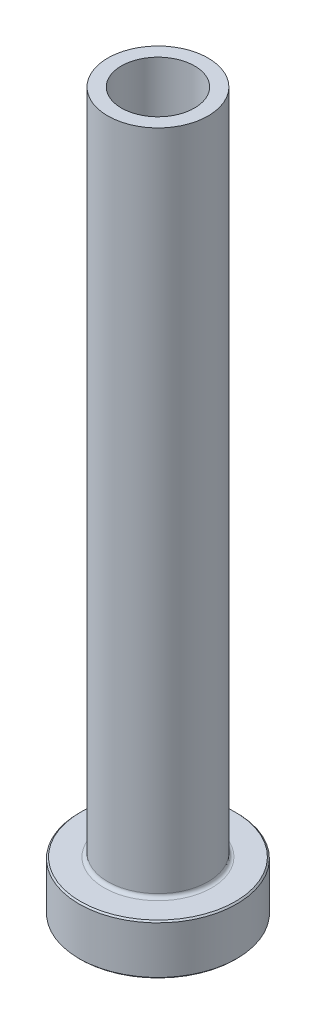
ISO-10303-21;
HEADER;
FILE_DESCRIPTION(('STEP AP214'),'2;1');
FILE_NAME('part.step','',(''),(''),'','','');
FILE_SCHEMA(('AUTOMOTIVE_DESIGN { 1 0 10303 214 1 1 1 1 }'));
ENDSEC;
DATA;
#1=APPLICATION_CONTEXT('core data for automotive mechanical design processes');
#2=APPLICATION_PROTOCOL_DEFINITION('international standard','automotive_design',2000,#1);
#3=PRODUCT_CONTEXT('',#1,'mechanical');
#4=PRODUCT('Part','Part','',(#3));
#5=PRODUCT_RELATED_PRODUCT_CATEGORY('part','',(#4));
#6=PRODUCT_DEFINITION_FORMATION('','',#4);
#7=PRODUCT_DEFINITION_CONTEXT('part definition',#1,'design');
#8=PRODUCT_DEFINITION('design','',#6,#7);
#9=PRODUCT_DEFINITION_SHAPE('','',#8);
#10=(LENGTH_UNIT() NAMED_UNIT(*) SI_UNIT(.MILLI.,.METRE.));
#11=(NAMED_UNIT(*) PLANE_ANGLE_UNIT() SI_UNIT($,.RADIAN.));
#12=(NAMED_UNIT(*) SI_UNIT($,.STERADIAN.) SOLID_ANGLE_UNIT());
#13=UNCERTAINTY_MEASURE_WITH_UNIT(LENGTH_MEASURE(1.E-05),#10,'distance_accuracy_value','');
#14=(GEOMETRIC_REPRESENTATION_CONTEXT(3) GLOBAL_UNCERTAINTY_ASSIGNED_CONTEXT((#13)) GLOBAL_UNIT_ASSIGNED_CONTEXT((#10,
#11,#12)) REPRESENTATION_CONTEXT('',''));
#15=CARTESIAN_POINT('',(0.,0.,0.));
#16=DIRECTION('',(0.,0.,1.));
#17=DIRECTION('',(1.,0.,0.));
#18=AXIS2_PLACEMENT_3D('',#15,#16,#17);
#19=CARTESIAN_POINT('',(0.,92.1876809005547,0.));
#20=DIRECTION('',(0.,1.,0.));
#21=DIRECTION('',(0.,0.,1.));
#22=AXIS2_PLACEMENT_3D('',#19,#20,#21);
#23=CYLINDRICAL_SURFACE('',#22,5.09999999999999);
#24=CARTESIAN_POINT('',(0.,100.,0.));
#25=DIRECTION('',(0.,1.,0.));
#26=DIRECTION('',(0.,0.,1.));
#27=AXIS2_PLACEMENT_3D('',#24,#25,#26);
#28=CIRCLE('',#27,5.09999999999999);
#29=CARTESIAN_POINT('',(0.,100.,5.09999999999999));
#30=VERTEX_POINT('',#29);
#31=EDGE_CURVE('E62',#30,#30,#28,.T.);
#32=ORIENTED_EDGE('',*,*,#31,.T.);
#33=EDGE_LOOP('',(#32));
#34=FACE_BOUND('',#33,.T.);
#35=CARTESIAN_POINT('',(0.,45.,0.));
#36=DIRECTION('',(0.,1.,0.));
#37=DIRECTION('',(0.,0.,1.));
#38=AXIS2_PLACEMENT_3D('',#35,#36,#37);
#39=CIRCLE('',#38,5.09999999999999);
#40=CARTESIAN_POINT('',(0.,45.,5.09999999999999));
#41=VERTEX_POINT('',#40);
#42=EDGE_CURVE('E71',#41,#41,#39,.T.);
#43=ORIENTED_EDGE('',*,*,#42,.F.);
#44=EDGE_LOOP('',(#43));
#45=FACE_BOUND('',#44,.T.);
#46=ADVANCED_FACE('F30',(#34,#45),#23,.F.);
#47=CARTESIAN_POINT('',(-5.09999999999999,100.,0.));
#48=DIRECTION('',(0.,1.,0.));
#49=DIRECTION('',(0.,0.,1.));
#50=AXIS2_PLACEMENT_3D('',#47,#48,#49);
#51=PLANE('',#50);
#52=CARTESIAN_POINT('',(0.,100.,0.));
#53=DIRECTION('',(0.,1.,0.));
#54=DIRECTION('',(0.,0.,1.));
#55=AXIS2_PLACEMENT_3D('',#52,#53,#54);
#56=CIRCLE('',#55,7.);
#57=CARTESIAN_POINT('',(0.,100.,7.));
#58=VERTEX_POINT('',#57);
#59=EDGE_CURVE('E65',#58,#58,#56,.T.);
#60=ORIENTED_EDGE('',*,*,#59,.T.);
#61=EDGE_LOOP('',(#60));
#62=FACE_BOUND('',#61,.T.);
#63=ORIENTED_EDGE('',*,*,#31,.F.);
#64=EDGE_LOOP('',(#63));
#65=FACE_BOUND('',#64,.T.);
#66=ADVANCED_FACE('F79',(#62,#65),#51,.T.);
#67=CARTESIAN_POINT('',(0.,92.1876809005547,0.));
#68=DIRECTION('',(0.,1.,0.));
#69=DIRECTION('',(0.,0.,1.));
#70=AXIS2_PLACEMENT_3D('',#67,#68,#69);
#71=CYLINDRICAL_SURFACE('',#70,7.);
#72=CARTESIAN_POINT('',(0.,7.50000000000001,0.));
#73=DIRECTION('',(0.,1.,0.));
#74=DIRECTION('',(0.,0.,1.));
#75=AXIS2_PLACEMENT_3D('',#72,#73,#74);
#76=CIRCLE('',#75,7.);
#77=CARTESIAN_POINT('',(0.,7.50000000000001,7.));
#78=VERTEX_POINT('',#77);
#79=EDGE_CURVE('E59',#78,#78,#76,.T.);
#80=ORIENTED_EDGE('',*,*,#79,.T.);
#81=EDGE_LOOP('',(#80));
#82=FACE_BOUND('',#81,.T.);
#83=ORIENTED_EDGE('',*,*,#59,.F.);
#84=EDGE_LOOP('',(#83));
#85=FACE_BOUND('',#84,.T.);
#86=ADVANCED_FACE('F85',(#82,#85),#71,.T.);
#87=CARTESIAN_POINT('',(-6.99999999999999,7.,0.));
#88=DIRECTION('',(0.,1.,0.));
#89=DIRECTION('',(0.,0.,1.));
#90=AXIS2_PLACEMENT_3D('',#87,#88,#89);
#91=PLANE('',#90);
#92=CARTESIAN_POINT('',(0.,7.,0.));
#93=DIRECTION('',(0.,1.,0.));
#94=DIRECTION('',(0.,0.,1.));
#95=AXIS2_PLACEMENT_3D('',#92,#93,#94);
#96=CIRCLE('',#95,10.8);
#97=CARTESIAN_POINT('',(0.,7.,10.8));
#98=VERTEX_POINT('',#97);
#99=EDGE_CURVE('E53',#98,#98,#96,.T.);
#100=ORIENTED_EDGE('',*,*,#99,.T.);
#101=EDGE_LOOP('',(#100));
#102=FACE_BOUND('',#101,.T.);
#103=CARTESIAN_POINT('',(0.,7.,0.));
#104=DIRECTION('',(0.,1.,0.));
#105=DIRECTION('',(0.,0.,1.));
#106=AXIS2_PLACEMENT_3D('',#103,#104,#105);
#107=CIRCLE('',#106,7.5);
#108=CARTESIAN_POINT('',(0.,7.,7.5));
#109=VERTEX_POINT('',#108);
#110=EDGE_CURVE('E56',#109,#109,#107,.F.);
#111=ORIENTED_EDGE('',*,*,#110,.T.);
#112=EDGE_LOOP('',(#111));
#113=FACE_BOUND('',#112,.T.);
#114=ADVANCED_FACE('F111',(#102,#113),#91,.T.);
#115=CARTESIAN_POINT('',(0.,92.1876809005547,0.));
#116=DIRECTION('',(0.,1.,0.));
#117=DIRECTION('',(0.,0.,1.));
#118=AXIS2_PLACEMENT_3D('',#115,#116,#117);
#119=CYLINDRICAL_SURFACE('',#118,11.);
#120=CARTESIAN_POINT('',(0.,6.80000000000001,0.));
#121=DIRECTION('',(0.,1.,0.));
#122=DIRECTION('',(0.,0.,1.));
#123=AXIS2_PLACEMENT_3D('',#120,#121,#122);
#124=CIRCLE('',#123,11.);
#125=CARTESIAN_POINT('',(0.,6.80000000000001,11.));
#126=VERTEX_POINT('',#125);
#127=EDGE_CURVE('E45',#126,#126,#124,.F.);
#128=ORIENTED_EDGE('',*,*,#127,.T.);
#129=EDGE_LOOP('',(#128));
#130=FACE_BOUND('',#129,.T.);
#131=CARTESIAN_POINT('',(0.,0.20000000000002,0.));
#132=DIRECTION('',(0.,-1.,0.));
#133=DIRECTION('',(0.,0.,-1.));
#134=AXIS2_PLACEMENT_3D('',#131,#132,#133);
#135=CIRCLE('',#134,11.);
#136=CARTESIAN_POINT('',(0.,0.20000000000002,-11.));
#137=VERTEX_POINT('',#136);
#138=EDGE_CURVE('E50',#137,#137,#135,.F.);
#139=ORIENTED_EDGE('',*,*,#138,.T.);
#140=EDGE_LOOP('',(#139));
#141=FACE_BOUND('',#140,.T.);
#142=ADVANCED_FACE('F108',(#130,#141),#119,.T.);
#143=CARTESIAN_POINT('',(-11.,0.,0.));
#144=DIRECTION('',(0.,-1.,0.));
#145=DIRECTION('',(0.,0.,-1.));
#146=AXIS2_PLACEMENT_3D('',#143,#144,#145);
#147=PLANE('',#146);
#148=CARTESIAN_POINT('',(0.,0.,0.));
#149=DIRECTION('',(0.,-1.,0.));
#150=DIRECTION('',(0.,0.,-1.));
#151=AXIS2_PLACEMENT_3D('',#148,#149,#150);
#152=CIRCLE('',#151,5.85000000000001);
#153=CARTESIAN_POINT('',(0.,0.,-5.85000000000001));
#154=VERTEX_POINT('',#153);
#155=EDGE_CURVE('E37',#154,#154,#152,.F.);
#156=ORIENTED_EDGE('',*,*,#155,.T.);
#157=EDGE_LOOP('',(#156));
#158=FACE_BOUND('',#157,.T.);
#159=CARTESIAN_POINT('',(0.,0.,0.));
#160=DIRECTION('',(0.,-1.,0.));
#161=DIRECTION('',(0.,0.,-1.));
#162=AXIS2_PLACEMENT_3D('',#159,#160,#161);
#163=CIRCLE('',#162,10.8);
#164=CARTESIAN_POINT('',(0.,0.,-10.8));
#165=VERTEX_POINT('',#164);
#166=EDGE_CURVE('E41',#165,#165,#163,.T.);
#167=ORIENTED_EDGE('',*,*,#166,.T.);
#168=EDGE_LOOP('',(#167));
#169=FACE_BOUND('',#168,.T.);
#170=ADVANCED_FACE('F110',(#158,#169),#147,.T.);
#171=CARTESIAN_POINT('',(0.,92.1876809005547,0.));
#172=DIRECTION('',(0.,1.,0.));
#173=DIRECTION('',(0.,0.,1.));
#174=AXIS2_PLACEMENT_3D('',#171,#172,#173);
#175=CYLINDRICAL_SURFACE('',#174,5.34999999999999);
#176=CARTESIAN_POINT('',(0.,0.500000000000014,0.));
#177=DIRECTION('',(0.,-1.,0.));
#178=DIRECTION('',(0.,0.,-1.));
#179=AXIS2_PLACEMENT_3D('',#176,#177,#178);
#180=CIRCLE('',#179,5.34999999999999);
#181=CARTESIAN_POINT('',(0.,0.500000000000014,-5.34999999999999));
#182=VERTEX_POINT('',#181);
#183=EDGE_CURVE('E10',#182,#182,#180,.T.);
#184=ORIENTED_EDGE('',*,*,#183,.T.);
#185=EDGE_LOOP('',(#184));
#186=FACE_BOUND('',#185,.T.);
#187=CARTESIAN_POINT('',(0.,33.,0.));
#188=DIRECTION('',(0.,1.,0.));
#189=DIRECTION('',(0.,0.,1.));
#190=AXIS2_PLACEMENT_3D('',#187,#188,#189);
#191=CIRCLE('',#190,5.34999999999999);
#192=CARTESIAN_POINT('',(0.,33.,5.34999999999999));
#193=VERTEX_POINT('',#192);
#194=EDGE_CURVE('E68',#193,#193,#191,.T.);
#195=ORIENTED_EDGE('',*,*,#194,.T.);
#196=EDGE_LOOP('',(#195));
#197=FACE_BOUND('',#196,.T.);
#198=ADVANCED_FACE('F118',(#186,#197),#175,.F.);
#199=CARTESIAN_POINT('',(0.,33.,0.));
#200=DIRECTION('',(0.,-1.,0.));
#201=DIRECTION('',(0.,0.,-1.));
#202=AXIS2_PLACEMENT_3D('',#199,#200,#201);
#203=CONICAL_SURFACE('',#202,5.34999999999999,0.0208303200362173);
#204=ORIENTED_EDGE('',*,*,#42,.T.);
#205=EDGE_LOOP('',(#204));
#206=FACE_BOUND('',#205,.T.);
#207=ORIENTED_EDGE('',*,*,#194,.F.);
#208=EDGE_LOOP('',(#207));
#209=FACE_BOUND('',#208,.T.);
#210=ADVANCED_FACE('F75',(#206,#209),#203,.F.);
#211=CARTESIAN_POINT('',(0.,7.50000000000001,0.));
#212=DIRECTION('',(0.,1.,0.));
#213=DIRECTION('',(0.,0.,1.));
#214=AXIS2_PLACEMENT_3D('',#211,#212,#213);
#215=TOROIDAL_SURFACE('',#214,7.5,0.5);
#216=ORIENTED_EDGE('',*,*,#110,.F.);
#217=EDGE_LOOP('',(#216));
#218=FACE_BOUND('',#217,.T.);
#219=ORIENTED_EDGE('',*,*,#79,.F.);
#220=EDGE_LOOP('',(#219));
#221=FACE_BOUND('',#220,.T.);
#222=ADVANCED_FACE('F90',(#218,#221),#215,.F.);
#223=CARTESIAN_POINT('',(0.,7.00000000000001,0.));
#224=DIRECTION('',(0.,-1.,0.));
#225=DIRECTION('',(0.,0.,-1.));
#226=AXIS2_PLACEMENT_3D('',#223,#224,#225);
#227=CONICAL_SURFACE('',#226,10.8,0.785398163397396);
#228=ORIENTED_EDGE('',*,*,#127,.F.);
#229=EDGE_LOOP('',(#228));
#230=FACE_BOUND('',#229,.T.);
#231=ORIENTED_EDGE('',*,*,#99,.F.);
#232=EDGE_LOOP('',(#231));
#233=FACE_BOUND('',#232,.T.);
#234=ADVANCED_FACE('F93',(#230,#233),#227,.T.);
#235=CARTESIAN_POINT('',(0.,0.20000000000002,0.));
#236=DIRECTION('',(0.,1.,0.));
#237=DIRECTION('',(0.,0.,1.));
#238=AXIS2_PLACEMENT_3D('',#235,#236,#237);
#239=CONICAL_SURFACE('',#238,11.,0.785398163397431);
#240=ORIENTED_EDGE('',*,*,#166,.F.);
#241=EDGE_LOOP('',(#240));
#242=FACE_BOUND('',#241,.T.);
#243=ORIENTED_EDGE('',*,*,#138,.F.);
#244=EDGE_LOOP('',(#243));
#245=FACE_BOUND('',#244,.T.);
#246=ADVANCED_FACE('F96',(#242,#245),#239,.T.);
#247=CARTESIAN_POINT('',(0.,0.,0.));
#248=DIRECTION('',(0.,-1.,0.));
#249=DIRECTION('',(0.,0.,-1.));
#250=AXIS2_PLACEMENT_3D('',#247,#248,#249);
#251=CONICAL_SURFACE('',#250,5.85000000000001,0.78539816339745);
#252=ORIENTED_EDGE('',*,*,#183,.F.);
#253=EDGE_LOOP('',(#252));
#254=FACE_BOUND('',#253,.T.);
#255=ORIENTED_EDGE('',*,*,#155,.F.);
#256=EDGE_LOOP('',(#255));
#257=FACE_BOUND('',#256,.T.);
#258=ADVANCED_FACE('F32',(#254,#257),#251,.F.);
#259=CLOSED_SHELL('',(#46,#66,#86,#114,#142,#170,#198,#210,#222,#234,#246,#258));
#260=MANIFOLD_SOLID_BREP('B2',#259);
#261=ADVANCED_BREP_SHAPE_REPRESENTATION('',(#18,#260),#14);
#262=SHAPE_DEFINITION_REPRESENTATION(#9,#261);
ENDSEC;
END-ISO-10303-21;
